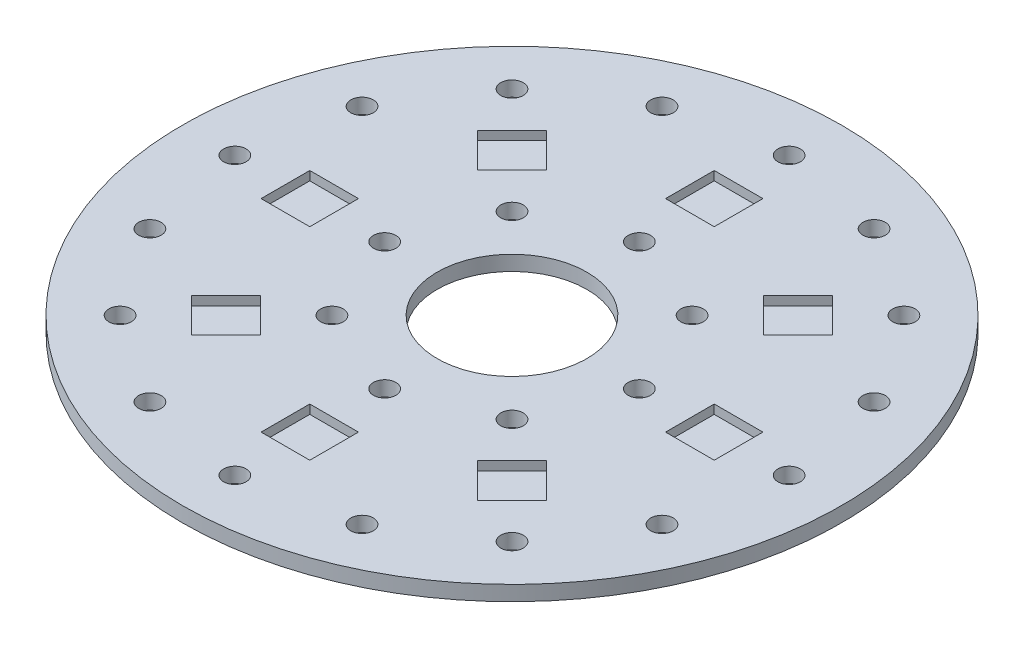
from build123d import *

# Parameters (mm, degrees)
SKETCH_1_W          = 34
SKETCH_1_H          = 2
SKETCH_2_R          = 1.5
CUT_EXTRUDE_3_DEPTH = 10
SKETCH_2_3_W        = 6.5
SKETCH_2_3_H        = 6.5
CUT_EXTRUDE_4_DEPTH = 1.2


with BuildPart() as part:
    # Sketch 1 → Revolve 1 (revolve)
    with BuildSketch(Plane.XY, mode=Mode.PRIVATE) as revolve_1_sk:
        with Locations((-27, 1)):
            Rectangle(SKETCH_1_W, SKETCH_1_H)
    revolve(revolve_1_sk.sketch.rotate(Axis((0, 0, 0), (0, 1, 0)), 270), axis=Axis((0, 0, 0), (0, 1, 0)))

    # Sketch 2 → Cut-Extrude 3 (cut)
    with BuildSketch(Plane(origin=(0, 2, 0), x_dir=(1, 0, 0), z_dir=(0, 1, 0))):
        with Locations(Location((-37, 0, 0), (0, 0, 270))):
            Circle(SKETCH_2_R)
        with Locations(Location((-17, 0, 0), (0, 0, 270))):
            Circle(SKETCH_2_R)
        with Locations(Location((-12.02081528, 12.02081528, 0), (0, 0, 270))):
            Circle(SKETCH_2_R)
        with Locations(Location((0, 17, 0), (0, 0, 270))):
            Circle(SKETCH_2_R)
        with Locations(Location((12.02081528, 12.02081528, 0), (0, 0, 270))):
            Circle(SKETCH_2_R)
        with Locations(Location((17, 0, 0), (0, 0, 270))):
            Circle(SKETCH_2_R)
        with Locations(Location((12.02081528, -12.02081528, 0), (0, 0, 270))):
            Circle(SKETCH_2_R)
        with Locations(Location((0, -17, 0), (0, 0, 270))):
            Circle(SKETCH_2_R)
        with Locations(Location((-12.02081528, -12.02081528, 0), (0, 0, 270))):
            Circle(SKETCH_2_R)
        with Locations(Location((-34.183542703, 14.159286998, 0), (0, 0, 270))):
            Circle(SKETCH_2_R)
        with Locations(Location((-26.162950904, 26.162950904, 0), (0, 0, 270))):
            Circle(SKETCH_2_R)
        with Locations(Location((-14.159286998, 34.183542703, 0), (0, 0, 270))):
            Circle(SKETCH_2_R)
        with Locations(Location((0, 37, 0), (0, 0, 270))):
            Circle(SKETCH_2_R)
        with Locations(Location((14.159286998, 34.183542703, 0), (0, 0, 270))):
            Circle(SKETCH_2_R)
        with Locations(Location((26.162950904, 26.162950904, 0), (0, 0, 270))):
            Circle(SKETCH_2_R)
        with Locations(Location((34.183542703, 14.159286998, 0), (0, 0, 270))):
            Circle(SKETCH_2_R)
        with Locations(Location((37, 0, 0), (0, 0, 270))):
            Circle(SKETCH_2_R)
        with Locations(Location((34.183542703, -14.159286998, 0), (0, 0, 270))):
            Circle(SKETCH_2_R)
        with Locations(Location((26.162950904, -26.162950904, 0), (0, 0, 270))):
            Circle(SKETCH_2_R)
        with Locations(Location((14.159286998, -34.183542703, 0), (0, 0, 270))):
            Circle(SKETCH_2_R)
        with Locations(Location((0, -37, 0), (0, 0, 270))):
            Circle(SKETCH_2_R)
        with Locations(Location((-14.159286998, -34.183542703, 0), (0, 0, 270))):
            Circle(SKETCH_2_R)
        with Locations(Location((-26.162950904, -26.162950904, 0), (0, 0, 270))):
            Circle(SKETCH_2_R)
        with Locations(Location((-34.183542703, -14.159286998, 0), (0, 0, 270))):
            Circle(SKETCH_2_R)
    extrude(amount=-CUT_EXTRUDE_3_DEPTH, mode=Mode.SUBTRACT)

    # Sketch 2_3 → Cut-Extrude 4 (cut)
    with BuildSketch(Plane(origin=(0, 2, 0), x_dir=(1, 0, 0), z_dir=(0, 1, 0))):
        Polygon((-14.495689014, 19.091883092), (-19.091883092, 14.495689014), (-23.68807717, 19.091883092), (-19.091883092, 23.68807717), align=None)
        with Locations((0, 27)):
            Rectangle(SKETCH_2_3_W, SKETCH_2_3_H)
        Polygon((19.091883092, 14.495689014), (14.495689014, 19.091883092), (19.091883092, 23.68807717), (23.68807717, 19.091883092), align=None)
        with Locations((-27, 0)):
            Rectangle(SKETCH_2_3_W, SKETCH_2_3_H)
        with Locations((27, 0)):
            Rectangle(SKETCH_2_3_W, SKETCH_2_3_H)
        Polygon((14.495689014, -19.091883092), (19.091883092, -14.495689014), (23.68807717, -19.091883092), (19.091883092, -23.68807717), align=None)
        with Locations((0, -27)):
            Rectangle(SKETCH_2_3_W, SKETCH_2_3_H)
        Polygon((-19.091883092, -14.495689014), (-14.495689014, -19.091883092), (-19.091883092, -23.68807717), (-23.68807717, -19.091883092), align=None)
    extrude(amount=-CUT_EXTRUDE_4_DEPTH, mode=Mode.SUBTRACT)


solid = part.part
